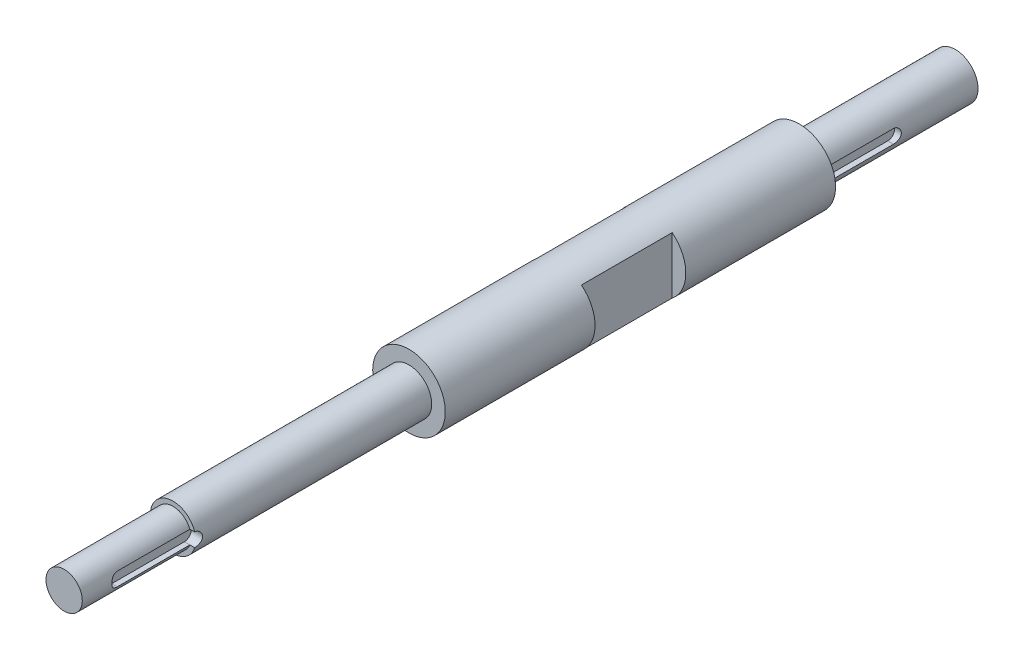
from build123d import *

# Parameters (mm, degrees)
SKETCH3_R               = 6.35
BOSS_EXTRUDE1_DEPTH     = 38.1
SKETCH5_R               = 7.9375
BOSS_EXTRUDE2_DEPTH     = 82.55
SKETCH6_R               = 12.7
BOSS_EXTRUDE3_DEPTH     = 136.525
CUT_EXTRUDE2_DEPTH      = 221.268127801
CUT_EXTRUDE2_DEPTH_BACK = 2.38125
SKETCH9_R               = 7.9375
BOSS_EXTRUDE4_DEPTH     = 54.61
CUT_EXTRUDE3_DEPTH      = 2.38125
CUT_EXTRUDE5_DEPTH      = 275.273694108
CUT_EXTRUDE5_DEPTH_BACK = 275.273694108
SKETCH15_W              = 4.7625
SKETCH15_H              = 31.75


with BuildPart() as part:
    # Sketch3 → Boss-Extrude1 (new body)
    with BuildSketch(Plane.XY):
        with Locations(Location((0, 0, 0), (0, 0, 180))):
            Circle(SKETCH3_R)
    extrude(amount=BOSS_EXTRUDE1_DEPTH)

    # Sketch5 → Boss-Extrude2 (add)
    with BuildSketch(Plane(origin=(0, 0, 0), x_dir=(-1, 0, 0), z_dir=(0, 0, -1))):
        Circle(SKETCH5_R)
    extrude(amount=BOSS_EXTRUDE2_DEPTH)

    # Sketch6 → Boss-Extrude3 (add)
    with BuildSketch(Plane(origin=(0, 0, -82.55), x_dir=(-1, 0, 0), z_dir=(0, 0, -1))):
        Circle(SKETCH6_R)
    extrude(amount=BOSS_EXTRUDE3_DEPTH)

    # Sketch8 → Cut-Extrude2 (cut, two sides: drawn at the far end of the back side and taken through both)
    with BuildSketch(Plane(origin=(6.35, 0, 0), x_dir=(0, 0, -1), z_dir=(1, 0, 0)).offset(-CUT_EXTRUDE2_DEPTH_BACK)):
        with BuildLine():
            Line((-25.4, 2.38125), (0, 2.38125))
            ThreePointArc((0, 2.38125), (2.38125, 0), (0, -2.38125))
            Line((0, -2.38125), (-25.4, -2.38125))
            ThreePointArc((-25.4, -2.38125), (-27.78125, 0), (-25.4, 2.38125))
        make_face()
    extrude(amount=CUT_EXTRUDE2_DEPTH + CUT_EXTRUDE2_DEPTH_BACK, mode=Mode.SUBTRACT)

    # Sketch9 → Boss-Extrude4 (add)
    with BuildSketch(Plane(origin=(0, 0, -219.075), x_dir=(-1, 0, 0), z_dir=(0, 0, -1))):
        with Locations(Location((0, 0, 0), (0, 0, 197.457603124))):
            Circle(SKETCH9_R)
    extrude(amount=BOSS_EXTRUDE4_DEPTH)

    # Sketch10 → Cut-Extrude3 (cut)
    with BuildSketch(Plane(origin=(7.9375, 0, 0), x_dir=(0, 0, -1), z_dir=(1, 0, 0))):
        with BuildLine():
            Line((219.075, 2.38125), (244.475, 2.38125))
            ThreePointArc((244.475, 2.38125), (246.85625, 0), (244.475, -2.38125))
            Line((244.475, -2.38125), (219.075, -2.38125))
            ThreePointArc((219.075, -2.38125), (216.69375, 0), (219.075, 2.38125))
        make_face()
    extrude(amount=-CUT_EXTRUDE3_DEPTH, mode=Mode.SUBTRACT)

    # Sketch15 → Cut-Extrude5 (cut, two sides: drawn at the far end of the back side and taken through both)
    with BuildSketch(Plane(origin=(0, 0, 0), x_dir=(1, 0, 0), z_dir=(0, 1, 0)).offset(-CUT_EXTRUDE5_DEPTH_BACK)):
        with Locations((-10.31875, 150.8125)):
            Rectangle(SKETCH15_W, SKETCH15_H)
        with Locations((10.31875, 150.8125)):
            Rectangle(SKETCH15_W, SKETCH15_H)
    extrude(amount=CUT_EXTRUDE5_DEPTH + CUT_EXTRUDE5_DEPTH_BACK, mode=Mode.SUBTRACT)


solid = part.part
